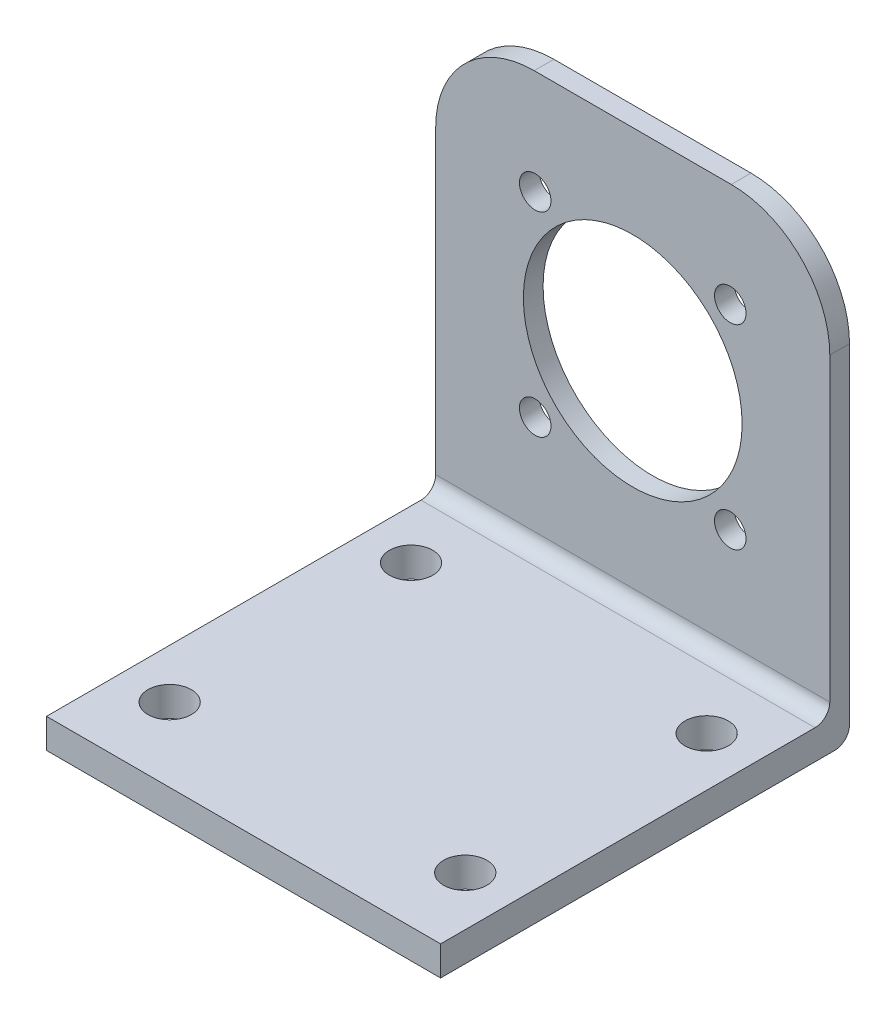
from build123d import *

# Parameters (mm, degrees)
SKETCH_1_R          = 11.1
EXTRUDE_1_DEPTH     = 2
SKETCH_2_W          = 41.5
SKETCH_2_H          = 3
EXTRUDE_2_DEPTH     = 40
FILLET_1_R          = 1.5
SKETCH_4_R          = 2.2
CUT_EXTRUDE_1_DEPTH = 3
SKETCH_6_R          = 1.6
CUT_EXTRUDE_3_DEPTH = 3


with BuildPart() as part:
    # Sketch 1 → Extrude 1 (new body)
    with BuildSketch(Plane.XY):
        with BuildLine():
            Line((10, 22.5), (-10, 22.5))
            ThreePointArc((-10, 22.5), (-17.071067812, 19.571067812), (-20, 12.5))
            Line((-20, 12.5), (-20, -22.5))
            Line((-20, -22.5), (20, -22.5))
            Line((20, -22.5), (20, 12.5))
            ThreePointArc((20, 12.5), (17.071067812, 19.571067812), (10, 22.5))
        make_face()
        with Locations((0, 2)):
            Circle(SKETCH_1_R, mode=Mode.SUBTRACT)
    extrude(amount=EXTRUDE_1_DEPTH)

    # Sketch 2 → Extrude 2 (add)
    with BuildSketch(Plane(origin=(20, 0, 0), x_dir=(0, 0, -1), z_dir=(1, 0, 0))):
        with Locations((-20.75, -21)):
            Rectangle(SKETCH_2_W, SKETCH_2_H)
    extrude(amount=-EXTRUDE_2_DEPTH)

    # Fillet 1
    fillet_1_edges = [part.edges().sort_by_distance(p)[0] for p in [
        (0, -19.5, 2),
        (0, -22.5, 0),
    ]]
    fillet(fillet_1_edges, radius=FILLET_1_R)

    # Sketch 4 → Cut-Extrude 1 (cut)
    with BuildSketch(Plane(origin=(0, -19.5, 0), x_dir=(1, 0, 0), z_dir=(0, 1, 0))):
        with Locations(Location((-15, -34, 0), (0, 0, 180))):
            Circle(SKETCH_4_R)
        with Locations(Location((-15, -9.5, 0), (0, 0, 180))):
            Circle(SKETCH_4_R)
        with Locations((15, -9.5)):
            Circle(SKETCH_4_R)
        with Locations((15, -34)):
            Circle(SKETCH_4_R)
    extrude(amount=-CUT_EXTRUDE_1_DEPTH, mode=Mode.SUBTRACT)

    # Sketch 6 → Cut-Extrude 3 (cut)
    with BuildSketch(Plane.XY.offset(2)):
        with Locations((9.899494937, 11.899494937)):
            Circle(SKETCH_6_R)
        with Locations((9.899494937, -7.899494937)):
            Circle(SKETCH_6_R)
        with Locations((-9.899494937, -7.899494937)):
            Circle(SKETCH_6_R)
        with Locations((-9.899494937, 11.899494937)):
            Circle(SKETCH_6_R)
    extrude(amount=-CUT_EXTRUDE_3_DEPTH, mode=Mode.SUBTRACT)


solid = part.part
